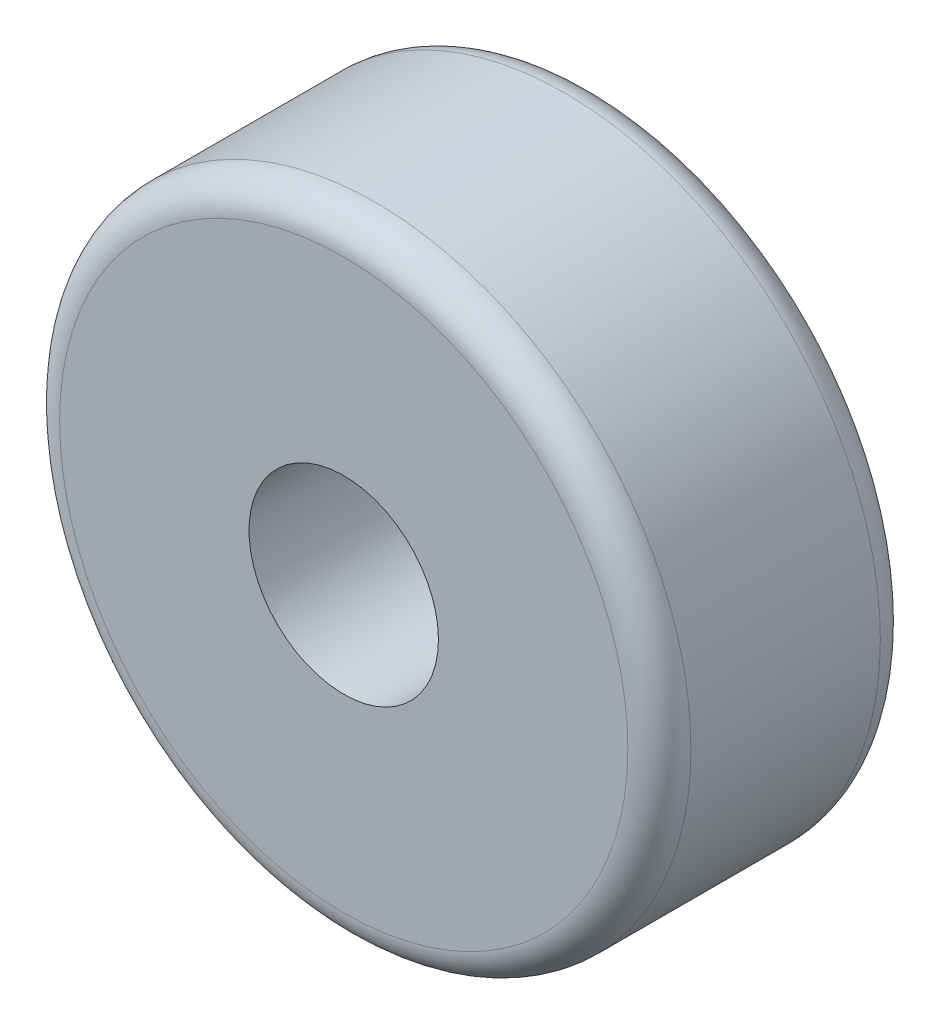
ISO-10303-21;
HEADER;
FILE_DESCRIPTION(('STEP AP214'),'2;1');
FILE_NAME('part.step','',(''),(''),'','','');
FILE_SCHEMA(('AUTOMOTIVE_DESIGN { 1 0 10303 214 1 1 1 1 }'));
ENDSEC;
DATA;
#1=APPLICATION_CONTEXT('core data for automotive mechanical design processes');
#2=APPLICATION_PROTOCOL_DEFINITION('international standard','automotive_design',2000,#1);
#3=PRODUCT_CONTEXT('',#1,'mechanical');
#4=PRODUCT('Part','Part','',(#3));
#5=PRODUCT_RELATED_PRODUCT_CATEGORY('part','',(#4));
#6=PRODUCT_DEFINITION_FORMATION('','',#4);
#7=PRODUCT_DEFINITION_CONTEXT('part definition',#1,'design');
#8=PRODUCT_DEFINITION('design','',#6,#7);
#9=PRODUCT_DEFINITION_SHAPE('','',#8);
#10=(LENGTH_UNIT() NAMED_UNIT(*) SI_UNIT(.MILLI.,.METRE.));
#11=(NAMED_UNIT(*) PLANE_ANGLE_UNIT() SI_UNIT($,.RADIAN.));
#12=(NAMED_UNIT(*) SI_UNIT($,.STERADIAN.) SOLID_ANGLE_UNIT());
#13=UNCERTAINTY_MEASURE_WITH_UNIT(LENGTH_MEASURE(1.E-05),#10,'distance_accuracy_value','');
#14=(GEOMETRIC_REPRESENTATION_CONTEXT(3) GLOBAL_UNCERTAINTY_ASSIGNED_CONTEXT((#13)) GLOBAL_UNIT_ASSIGNED_CONTEXT((#10,
#11,#12)) REPRESENTATION_CONTEXT('',''));
#15=CARTESIAN_POINT('',(0.,0.,0.));
#16=DIRECTION('',(0.,0.,1.));
#17=DIRECTION('',(1.,0.,0.));
#18=AXIS2_PLACEMENT_3D('',#15,#16,#17);
#19=CARTESIAN_POINT('',(0.,-6.,16.));
#20=DIRECTION('',(0.,0.,1.));
#21=DIRECTION('',(1.,0.,0.));
#22=AXIS2_PLACEMENT_3D('',#19,#20,#21);
#23=PLANE('',#22);
#24=CARTESIAN_POINT('',(0.,0.,16.));
#25=DIRECTION('',(0.,0.,1.));
#26=DIRECTION('',(1.,0.,0.));
#27=AXIS2_PLACEMENT_3D('',#24,#25,#26);
#28=CIRCLE('',#27,18.);
#29=CARTESIAN_POINT('',(18.,0.,16.));
#30=VERTEX_POINT('',#29);
#31=EDGE_CURVE('E8',#30,#30,#28,.T.);
#32=ORIENTED_EDGE('',*,*,#31,.T.);
#33=EDGE_LOOP('',(#32));
#34=FACE_BOUND('',#33,.T.);
#35=CARTESIAN_POINT('',(0.,0.,16.));
#36=DIRECTION('',(0.,0.,1.));
#37=DIRECTION('',(1.,0.,0.));
#38=AXIS2_PLACEMENT_3D('',#35,#36,#37);
#39=CIRCLE('',#38,6.);
#40=CARTESIAN_POINT('',(6.,0.,16.));
#41=VERTEX_POINT('',#40);
#42=EDGE_CURVE('E34',#41,#41,#39,.T.);
#43=ORIENTED_EDGE('',*,*,#42,.F.);
#44=EDGE_LOOP('',(#43));
#45=FACE_BOUND('',#44,.T.);
#46=ADVANCED_FACE('F12',(#34,#45),#23,.T.);
#47=CARTESIAN_POINT('',(0.,0.,14.));
#48=DIRECTION('',(0.,0.,1.));
#49=DIRECTION('',(1.,0.,0.));
#50=AXIS2_PLACEMENT_3D('',#47,#48,#49);
#51=TOROIDAL_SURFACE('',#50,18.,2.);
#52=CARTESIAN_POINT('',(0.,0.,14.));
#53=DIRECTION('',(0.,0.,1.));
#54=DIRECTION('',(1.,0.,0.));
#55=AXIS2_PLACEMENT_3D('',#52,#53,#54);
#56=CIRCLE('',#55,20.);
#57=CARTESIAN_POINT('',(20.,0.,14.));
#58=VERTEX_POINT('',#57);
#59=EDGE_CURVE('E18',#58,#58,#56,.T.);
#60=ORIENTED_EDGE('',*,*,#59,.T.);
#61=EDGE_LOOP('',(#60));
#62=FACE_BOUND('',#61,.T.);
#63=ORIENTED_EDGE('',*,*,#31,.F.);
#64=EDGE_LOOP('',(#63));
#65=FACE_BOUND('',#64,.T.);
#66=ADVANCED_FACE('F41',(#62,#65),#51,.T.);
#67=CARTESIAN_POINT('',(0.,0.,32.9727316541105));
#68=DIRECTION('',(0.,0.,1.));
#69=DIRECTION('',(1.,0.,0.));
#70=AXIS2_PLACEMENT_3D('',#67,#68,#69);
#71=CYLINDRICAL_SURFACE('',#70,20.);
#72=CARTESIAN_POINT('',(0.,0.,2.));
#73=DIRECTION('',(0.,0.,1.));
#74=DIRECTION('',(1.,0.,0.));
#75=AXIS2_PLACEMENT_3D('',#72,#73,#74);
#76=CIRCLE('',#75,20.);
#77=CARTESIAN_POINT('',(20.,0.,2.));
#78=VERTEX_POINT('',#77);
#79=EDGE_CURVE('E22',#78,#78,#76,.T.);
#80=ORIENTED_EDGE('',*,*,#79,.T.);
#81=EDGE_LOOP('',(#80));
#82=FACE_BOUND('',#81,.T.);
#83=ORIENTED_EDGE('',*,*,#59,.F.);
#84=EDGE_LOOP('',(#83));
#85=FACE_BOUND('',#84,.T.);
#86=ADVANCED_FACE('F47',(#82,#85),#71,.T.);
#87=CARTESIAN_POINT('',(0.,0.,2.));
#88=DIRECTION('',(0.,0.,1.));
#89=DIRECTION('',(1.,0.,0.));
#90=AXIS2_PLACEMENT_3D('',#87,#88,#89);
#91=TOROIDAL_SURFACE('',#90,18.,2.);
#92=CARTESIAN_POINT('',(0.,0.,0.));
#93=DIRECTION('',(0.,0.,1.));
#94=DIRECTION('',(1.,0.,0.));
#95=AXIS2_PLACEMENT_3D('',#92,#93,#94);
#96=CIRCLE('',#95,18.);
#97=CARTESIAN_POINT('',(18.,0.,0.));
#98=VERTEX_POINT('',#97);
#99=EDGE_CURVE('E26',#98,#98,#96,.T.);
#100=ORIENTED_EDGE('',*,*,#99,.T.);
#101=EDGE_LOOP('',(#100));
#102=FACE_BOUND('',#101,.T.);
#103=ORIENTED_EDGE('',*,*,#79,.F.);
#104=EDGE_LOOP('',(#103));
#105=FACE_BOUND('',#104,.T.);
#106=ADVANCED_FACE('F52',(#102,#105),#91,.T.);
#107=CARTESIAN_POINT('',(0.,-18.,0.));
#108=DIRECTION('',(0.,0.,-1.));
#109=DIRECTION('',(-1.,0.,0.));
#110=AXIS2_PLACEMENT_3D('',#107,#108,#109);
#111=PLANE('',#110);
#112=CARTESIAN_POINT('',(0.,0.,0.));
#113=DIRECTION('',(0.,0.,1.));
#114=DIRECTION('',(1.,0.,0.));
#115=AXIS2_PLACEMENT_3D('',#112,#113,#114);
#116=CIRCLE('',#115,6.);
#117=CARTESIAN_POINT('',(6.,0.,0.));
#118=VERTEX_POINT('',#117);
#119=EDGE_CURVE('E31',#118,#118,#116,.T.);
#120=ORIENTED_EDGE('',*,*,#119,.T.);
#121=EDGE_LOOP('',(#120));
#122=FACE_BOUND('',#121,.T.);
#123=ORIENTED_EDGE('',*,*,#99,.F.);
#124=EDGE_LOOP('',(#123));
#125=FACE_BOUND('',#124,.T.);
#126=ADVANCED_FACE('F59',(#122,#125),#111,.T.);
#127=CARTESIAN_POINT('',(0.,0.,32.9727316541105));
#128=DIRECTION('',(0.,0.,1.));
#129=DIRECTION('',(1.,0.,0.));
#130=AXIS2_PLACEMENT_3D('',#127,#128,#129);
#131=CYLINDRICAL_SURFACE('',#130,6.);
#132=ORIENTED_EDGE('',*,*,#119,.F.);
#133=EDGE_LOOP('',(#132));
#134=FACE_BOUND('',#133,.T.);
#135=ORIENTED_EDGE('',*,*,#42,.T.);
#136=EDGE_LOOP('',(#135));
#137=FACE_BOUND('',#136,.T.);
#138=ADVANCED_FACE('F38',(#134,#137),#131,.F.);
#139=CLOSED_SHELL('',(#46,#66,#86,#106,#126,#138));
#140=MANIFOLD_SOLID_BREP('B1',#139);
#141=ADVANCED_BREP_SHAPE_REPRESENTATION('',(#18,#140),#14);
#142=SHAPE_DEFINITION_REPRESENTATION(#9,#141);
ENDSEC;
END-ISO-10303-21;
